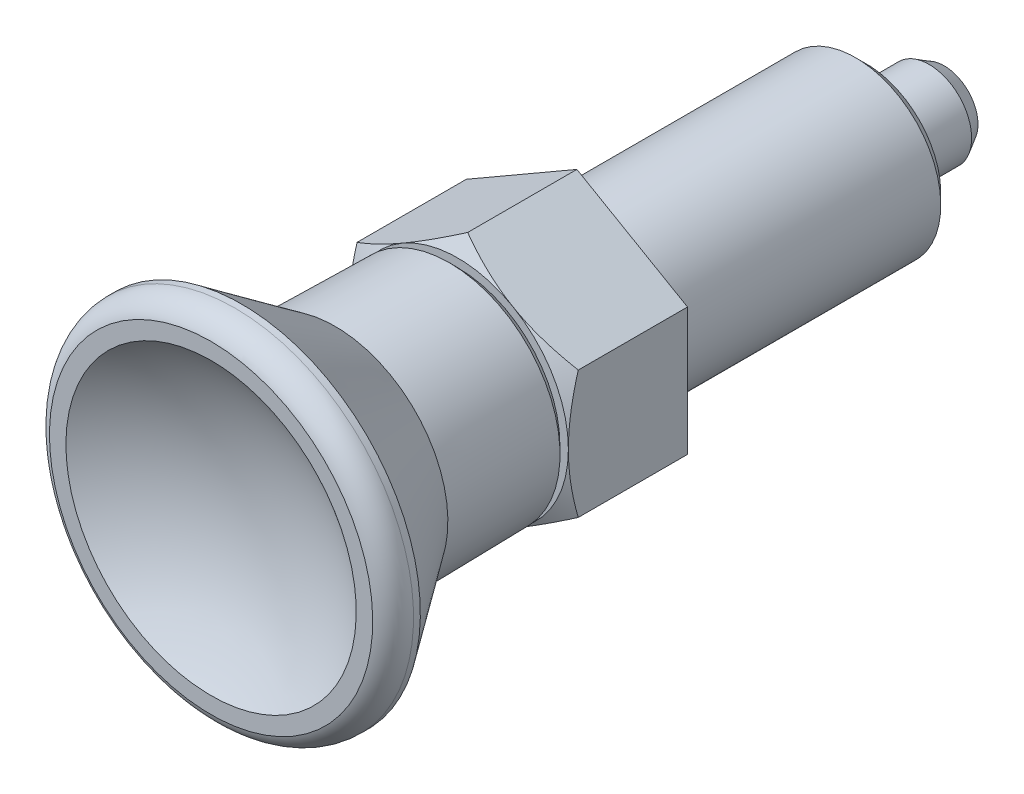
ISO-10303-21;
HEADER;
FILE_DESCRIPTION(('STEP AP214'),'2;1');
FILE_NAME('part.step','',(''),(''),'','','');
FILE_SCHEMA(('AUTOMOTIVE_DESIGN { 1 0 10303 214 1 1 1 1 }'));
ENDSEC;
DATA;
#1=APPLICATION_CONTEXT('core data for automotive mechanical design processes');
#2=APPLICATION_PROTOCOL_DEFINITION('international standard','automotive_design',2000,#1);
#3=PRODUCT_CONTEXT('',#1,'mechanical');
#4=PRODUCT('Part','Part','',(#3));
#5=PRODUCT_RELATED_PRODUCT_CATEGORY('part','',(#4));
#6=PRODUCT_DEFINITION_FORMATION('','',#4);
#7=PRODUCT_DEFINITION_CONTEXT('part definition',#1,'design');
#8=PRODUCT_DEFINITION('design','',#6,#7);
#9=PRODUCT_DEFINITION_SHAPE('','',#8);
#10=(LENGTH_UNIT() NAMED_UNIT(*) SI_UNIT(.MILLI.,.METRE.));
#11=(NAMED_UNIT(*) PLANE_ANGLE_UNIT() SI_UNIT($,.RADIAN.));
#12=(NAMED_UNIT(*) SI_UNIT($,.STERADIAN.) SOLID_ANGLE_UNIT());
#13=UNCERTAINTY_MEASURE_WITH_UNIT(LENGTH_MEASURE(1.E-05),#10,'distance_accuracy_value','');
#14=(GEOMETRIC_REPRESENTATION_CONTEXT(3) GLOBAL_UNCERTAINTY_ASSIGNED_CONTEXT((#13)) GLOBAL_UNIT_ASSIGNED_CONTEXT((#10,
#11,#12)) REPRESENTATION_CONTEXT('',''));
#15=CARTESIAN_POINT('',(0.,0.,0.));
#16=DIRECTION('',(0.,0.,1.));
#17=DIRECTION('',(1.,0.,0.));
#18=AXIS2_PLACEMENT_3D('',#15,#16,#17);
#19=CARTESIAN_POINT('',(0.,0.,-17.));
#20=DIRECTION('',(-1.,0.,0.));
#21=DIRECTION('',(0.,1.,0.));
#22=AXIS2_PLACEMENT_3D('',#19,#20,#21);
#23=SPHERICAL_SURFACE('',#22,5.);
#24=CARTESIAN_POINT('',(0.,0.,-21.5881225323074));
#25=DIRECTION('',(0.,0.,1.));
#26=DIRECTION('',(0.,-1.,0.));
#27=AXIS2_PLACEMENT_3D('',#24,#25,#26);
#28=CIRCLE('',#27,1.98724221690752);
#29=CARTESIAN_POINT('',(0.,-1.98724221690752,-21.5881225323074));
#30=VERTEX_POINT('',#29);
#31=EDGE_CURVE('E18',#30,#30,#28,.T.);
#32=ORIENTED_EDGE('',*,*,#31,.F.);
#33=EDGE_LOOP('',(#32));
#34=FACE_BOUND('',#33,.T.);
#35=ADVANCED_FACE('F14',(#34),#23,.T.);
#36=CARTESIAN_POINT('',(0.,0.,-20.7000000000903));
#37=DIRECTION('',(0.,0.,1.));
#38=DIRECTION('',(0.,-1.,0.));
#39=AXIS2_PLACEMENT_3D('',#36,#37,#38);
#40=CONICAL_SURFACE('',#39,2.49999999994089,0.523598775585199);
#41=CARTESIAN_POINT('',(0.,0.,-20.7));
#42=DIRECTION('',(0.,0.,1.));
#43=DIRECTION('',(0.,-1.,0.));
#44=AXIS2_PLACEMENT_3D('',#41,#42,#43);
#45=CIRCLE('',#44,2.5);
#46=CARTESIAN_POINT('',(0.,-2.5,-20.7));
#47=VERTEX_POINT('',#46);
#48=EDGE_CURVE('E190',#47,#47,#45,.T.);
#49=ORIENTED_EDGE('',*,*,#48,.F.);
#50=EDGE_LOOP('',(#49));
#51=FACE_BOUND('',#50,.T.);
#52=ORIENTED_EDGE('',*,*,#31,.T.);
#53=EDGE_LOOP('',(#52));
#54=FACE_BOUND('',#53,.T.);
#55=ADVANCED_FACE('F297',(#51,#54),#40,.T.);
#56=CARTESIAN_POINT('',(0.,0.,-22.));
#57=DIRECTION('',(0.,0.,1.));
#58=DIRECTION('',(0.,-1.,0.));
#59=AXIS2_PLACEMENT_3D('',#56,#57,#58);
#60=CYLINDRICAL_SURFACE('',#59,2.5);
#61=CARTESIAN_POINT('',(0.,0.,-17.4999999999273));
#62=DIRECTION('',(0.,0.,-1.));
#63=DIRECTION('',(0.,1.,0.));
#64=AXIS2_PLACEMENT_3D('',#61,#62,#63);
#65=CIRCLE('',#64,2.49999999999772);
#66=CARTESIAN_POINT('',(0.,2.49999999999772,-17.4999999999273));
#67=VERTEX_POINT('',#66);
#68=EDGE_CURVE('E185',#67,#67,#65,.F.);
#69=ORIENTED_EDGE('',*,*,#68,.F.);
#70=EDGE_LOOP('',(#69));
#71=FACE_BOUND('',#70,.T.);
#72=ORIENTED_EDGE('',*,*,#48,.T.);
#73=EDGE_LOOP('',(#72));
#74=FACE_BOUND('',#73,.T.);
#75=ADVANCED_FACE('F292',(#71,#74),#60,.T.);
#76=CARTESIAN_POINT('',(0.,0.,-17.4999999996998));
#77=DIRECTION('',(0.,0.,-1.));
#78=DIRECTION('',(0.,1.,0.));
#79=AXIS2_PLACEMENT_3D('',#76,#77,#78);
#80=CONICAL_SURFACE('',#79,2.49999999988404,0.523598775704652);
#81=CARTESIAN_POINT('',(0.,0.,-17.3267949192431));
#82=DIRECTION('',(0.,0.,1.));
#83=DIRECTION('',(0.,-1.,0.));
#84=AXIS2_PLACEMENT_3D('',#81,#82,#83);
#85=CIRCLE('',#84,2.4);
#86=CARTESIAN_POINT('',(0.,-2.4,-17.3267949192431));
#87=VERTEX_POINT('',#86);
#88=EDGE_CURVE('E176',#87,#87,#85,.T.);
#89=ORIENTED_EDGE('',*,*,#88,.F.);
#90=EDGE_LOOP('',(#89));
#91=FACE_BOUND('',#90,.T.);
#92=ORIENTED_EDGE('',*,*,#68,.T.);
#93=EDGE_LOOP('',(#92));
#94=FACE_BOUND('',#93,.T.);
#95=ADVANCED_FACE('F287',(#91,#94),#80,.T.);
#96=CARTESIAN_POINT('',(0.,0.,-22.));
#97=DIRECTION('',(0.,0.,1.));
#98=DIRECTION('',(0.,-1.,0.));
#99=AXIS2_PLACEMENT_3D('',#96,#97,#98);
#100=CYLINDRICAL_SURFACE('',#99,2.4);
#101=CARTESIAN_POINT('',(0.,0.,-17.1999999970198));
#102=DIRECTION('',(0.,0.,-1.));
#103=DIRECTION('',(0.,1.,0.));
#104=AXIS2_PLACEMENT_3D('',#101,#102,#103);
#105=CIRCLE('',#104,2.4);
#106=CARTESIAN_POINT('',(0.,2.4,-17.1999999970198));
#107=VERTEX_POINT('',#106);
#108=EDGE_CURVE('E184',#107,#107,#105,.T.);
#109=ORIENTED_EDGE('',*,*,#108,.T.);
#110=EDGE_LOOP('',(#109));
#111=FACE_BOUND('',#110,.T.);
#112=ORIENTED_EDGE('',*,*,#88,.T.);
#113=EDGE_LOOP('',(#112));
#114=FACE_BOUND('',#113,.T.);
#115=ADVANCED_FACE('F167',(#111,#114),#100,.T.);
#116=CARTESIAN_POINT('',(0.,0.,-17.2));
#117=DIRECTION('',(0.,0.,-1.));
#118=DIRECTION('',(0.,1.,0.));
#119=AXIS2_PLACEMENT_3D('',#116,#117,#118);
#120=TOROIDAL_SURFACE('',#119,2.6,0.200000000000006);
#121=CARTESIAN_POINT('',(0.,0.,-17.));
#122=DIRECTION('',(0.,0.,-1.));
#123=DIRECTION('',(0.,1.,0.));
#124=AXIS2_PLACEMENT_3D('',#121,#122,#123);
#125=CIRCLE('',#124,2.59999999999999);
#126=CARTESIAN_POINT('',(0.,2.59999999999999,-17.));
#127=VERTEX_POINT('',#126);
#128=EDGE_CURVE('E143',#127,#127,#125,.T.);
#129=ORIENTED_EDGE('',*,*,#128,.T.);
#130=EDGE_LOOP('',(#129));
#131=FACE_BOUND('',#130,.T.);
#132=ORIENTED_EDGE('',*,*,#108,.F.);
#133=EDGE_LOOP('',(#132));
#134=FACE_BOUND('',#133,.T.);
#135=ADVANCED_FACE('F161',(#131,#134),#120,.F.);
#136=CARTESIAN_POINT('',(2.82679491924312,0.,-17.));
#137=DIRECTION('',(0.,0.,1.));
#138=DIRECTION('',(0.,-1.,0.));
#139=AXIS2_PLACEMENT_3D('',#136,#137,#138);
#140=PLANE('',#139);
#141=CARTESIAN_POINT('',(0.,0.,-17.0000000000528));
#142=DIRECTION('',(0.,0.,1.));
#143=DIRECTION('',(0.,-1.,0.));
#144=AXIS2_PLACEMENT_3D('',#141,#142,#143);
#145=CIRCLE('',#144,2.82679491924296);
#146=CARTESIAN_POINT('',(0.,-2.82679491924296,-17.0000000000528));
#147=VERTEX_POINT('',#146);
#148=EDGE_CURVE('E136',#147,#147,#145,.T.);
#149=ORIENTED_EDGE('',*,*,#148,.F.);
#150=EDGE_LOOP('',(#149));
#151=FACE_BOUND('',#150,.T.);
#152=ORIENTED_EDGE('',*,*,#128,.F.);
#153=EDGE_LOOP('',(#152));
#154=FACE_BOUND('',#153,.T.);
#155=ADVANCED_FACE('F150',(#151,#154),#140,.F.);
#156=CARTESIAN_POINT('',(0.,0.,-16.7000000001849));
#157=DIRECTION('',(0.,0.,1.));
#158=DIRECTION('',(0.,-1.,0.));
#159=AXIS2_PLACEMENT_3D('',#156,#157,#158);
#160=CONICAL_SURFACE('',#159,2.99999999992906,0.52359877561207);
#161=CARTESIAN_POINT('',(0.,0.,-16.7));
#162=DIRECTION('',(0.,0.,1.));
#163=DIRECTION('',(0.,-1.,0.));
#164=AXIS2_PLACEMENT_3D('',#161,#162,#163);
#165=CIRCLE('',#164,3.);
#166=CARTESIAN_POINT('',(0.,-3.,-16.7));
#167=VERTEX_POINT('',#166);
#168=EDGE_CURVE('E132',#167,#167,#165,.F.);
#169=ORIENTED_EDGE('',*,*,#168,.T.);
#170=EDGE_LOOP('',(#169));
#171=FACE_BOUND('',#170,.T.);
#172=ORIENTED_EDGE('',*,*,#148,.T.);
#173=EDGE_LOOP('',(#172));
#174=FACE_BOUND('',#173,.T.);
#175=ADVANCED_FACE('F160',(#171,#174),#160,.T.);
#176=CARTESIAN_POINT('',(0.,0.,-17.));
#177=DIRECTION('',(0.,0.,1.));
#178=DIRECTION('',(0.,-1.,0.));
#179=AXIS2_PLACEMENT_3D('',#176,#177,#178);
#180=CYLINDRICAL_SURFACE('',#179,3.);
#181=ORIENTED_EDGE('',*,*,#168,.F.);
#182=EDGE_LOOP('',(#181));
#183=FACE_BOUND('',#182,.T.);
#184=CARTESIAN_POINT('',(0.,0.,-17.));
#185=DIRECTION('',(0.,0.,1.));
#186=DIRECTION('',(0.,-1.,0.));
#187=AXIS2_PLACEMENT_3D('',#184,#185,#186);
#188=CIRCLE('',#187,3.);
#189=CARTESIAN_POINT('',(0.,-3.,-17.));
#190=VERTEX_POINT('',#189);
#191=EDGE_CURVE('E135',#190,#190,#188,.T.);
#192=ORIENTED_EDGE('',*,*,#191,.F.);
#193=EDGE_LOOP('',(#192));
#194=FACE_BOUND('',#193,.T.);
#195=ADVANCED_FACE('F255',(#183,#194),#180,.F.);
#196=CARTESIAN_POINT('',(3.,0.,-17.));
#197=DIRECTION('',(0.,0.,-1.));
#198=DIRECTION('',(0.,1.,0.));
#199=AXIS2_PLACEMENT_3D('',#196,#197,#198);
#200=PLANE('',#199);
#201=ORIENTED_EDGE('',*,*,#191,.T.);
#202=EDGE_LOOP('',(#201));
#203=FACE_BOUND('',#202,.T.);
#204=CARTESIAN_POINT('',(0.,0.,-16.9999999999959));
#205=DIRECTION('',(0.,0.,1.));
#206=DIRECTION('',(0.,-1.,0.));
#207=AXIS2_PLACEMENT_3D('',#204,#205,#206);
#208=CIRCLE('',#207,4.38650000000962);
#209=CARTESIAN_POINT('',(0.,-4.38650000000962,-16.9999999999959));
#210=VERTEX_POINT('',#209);
#211=EDGE_CURVE('E129',#210,#210,#208,.T.);
#212=ORIENTED_EDGE('',*,*,#211,.F.);
#213=EDGE_LOOP('',(#212));
#214=FACE_BOUND('',#213,.T.);
#215=ADVANCED_FACE('F246',(#203,#214),#200,.T.);
#216=CARTESIAN_POINT('',(0.,0.,-16.38650000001));
#217=DIRECTION('',(0.,0.,1.));
#218=DIRECTION('',(0.,-1.,0.));
#219=AXIS2_PLACEMENT_3D('',#216,#217,#218);
#220=CONICAL_SURFACE('',#219,5.0000000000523,0.785398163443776);
#221=ORIENTED_EDGE('',*,*,#211,.T.);
#222=EDGE_LOOP('',(#221));
#223=FACE_BOUND('',#222,.T.);
#224=CARTESIAN_POINT('',(0.,0.,-16.3865));
#225=DIRECTION('',(0.,0.,1.));
#226=DIRECTION('',(0.,-1.,0.));
#227=AXIS2_PLACEMENT_3D('',#224,#225,#226);
#228=CIRCLE('',#227,5.);
#229=CARTESIAN_POINT('',(0.,-5.,-16.3865));
#230=VERTEX_POINT('',#229);
#231=EDGE_CURVE('E126',#230,#230,#228,.T.);
#232=ORIENTED_EDGE('',*,*,#231,.F.);
#233=EDGE_LOOP('',(#232));
#234=FACE_BOUND('',#233,.T.);
#235=ADVANCED_FACE('F244',(#223,#234),#220,.T.);
#236=CARTESIAN_POINT('',(0.,0.,32.6));
#237=DIRECTION('',(-1.,0.,0.));
#238=DIRECTION('',(0.,1.,0.));
#239=AXIS2_PLACEMENT_3D('',#236,#237,#238);
#240=SPHERICAL_SURFACE('',#239,14.);
#241=CARTESIAN_POINT('',(0.,8.53170557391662,21.5));
#242=CARTESIAN_POINT('',(-0.239701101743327,8.5317072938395,21.5));
#243=CARTESIAN_POINT('',(-0.479373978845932,8.52159969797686,21.5));
#244=CARTESIAN_POINT('',(-0.95709617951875,8.48123987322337,21.5));
#245=CARTESIAN_POINT('',(-1.19514505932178,8.45098234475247,21.5));
#246=CARTESIAN_POINT('',(-1.66809840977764,8.37048717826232,21.5));
#247=CARTESIAN_POINT('',(-1.90299924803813,8.3202282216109,21.5));
#248=CARTESIAN_POINT('',(-2.36773233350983,8.20008811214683,21.5));
#249=CARTESIAN_POINT('',(-2.59756451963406,8.13020672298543,21.5));
#250=CARTESIAN_POINT('',(-3.05040854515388,7.97135842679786,21.5));
#251=CARTESIAN_POINT('',(-3.27342368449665,7.88240092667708,21.5));
#252=CARTESIAN_POINT('',(-3.71116976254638,7.68601114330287,21.5));
#253=CARTESIAN_POINT('',(-3.92590057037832,7.57857856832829,21.5));
#254=CARTESIAN_POINT('',(-4.34545679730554,7.34605366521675,21.5));
#255=CARTESIAN_POINT('',(-4.55028643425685,7.22096894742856,21.5));
#256=CARTESIAN_POINT('',(-4.94875279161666,6.95394741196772,21.5));
#257=CARTESIAN_POINT('',(-5.14238561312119,6.81200477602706,21.5));
#258=CARTESIAN_POINT('',(-5.51699044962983,6.51232267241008,21.5));
#259=CARTESIAN_POINT('',(-5.69796342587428,6.354584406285,21.5));
#260=CARTESIAN_POINT('',(-6.04598097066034,6.02442080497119,21.5));
#261=CARTESIAN_POINT('',(-6.21302532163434,5.85199524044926,21.5));
#262=CARTESIAN_POINT('',(-6.53199815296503,5.49368132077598,21.5));
#263=CARTESIAN_POINT('',(-6.68392632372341,5.30779269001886,21.5));
#264=CARTESIAN_POINT('',(-6.97158596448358,4.92387306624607,21.5));
#265=CARTESIAN_POINT('',(-7.10731707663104,4.72584180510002,21.5));
#266=CARTESIAN_POINT('',(-7.36158785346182,4.31908993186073,21.5));
#267=CARTESIAN_POINT('',(-7.48013099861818,4.11037149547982,21.5));
#268=CARTESIAN_POINT('',(-7.69925411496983,3.68361770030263,21.5));
#269=CARTESIAN_POINT('',(-7.79982785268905,3.46557914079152,21.5));
#270=CARTESIAN_POINT('',(-7.98222972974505,3.02184395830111,21.5));
#271=CARTESIAN_POINT('',(-8.06406129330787,2.79614874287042,21.5));
#272=CARTESIAN_POINT('',(-8.20842175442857,2.33866337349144,21.5));
#273=CARTESIAN_POINT('',(-8.27095035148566,2.10687312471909,21.5));
#274=CARTESIAN_POINT('',(-8.37625770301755,1.63885297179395,21.5));
#275=CARTESIAN_POINT('',(-8.41903679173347,1.40262314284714,21.5));
#276=CARTESIAN_POINT('',(-8.48454328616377,0.927394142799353,21.5));
#277=CARTESIAN_POINT('',(-8.50727024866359,0.688394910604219,21.5));
#278=CARTESIAN_POINT('',(-8.53250695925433,0.209376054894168,21.5));
#279=CARTESIAN_POINT('',(-8.53502046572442,-0.0306433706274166,21.5));
#280=CARTESIAN_POINT('',(-8.51981962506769,-0.510124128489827,21.5));
#281=CARTESIAN_POINT('',(-8.50209827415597,-0.749585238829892,21.5));
#282=CARTESIAN_POINT('',(-8.44654739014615,-1.22611973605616,21.5));
#283=CARTESIAN_POINT('',(-8.40872148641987,-1.46319354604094,21.5));
#284=CARTESIAN_POINT('',(-8.31323191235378,-1.93331562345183,21.5));
#285=CARTESIAN_POINT('',(-8.2555679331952,-2.16636382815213,21.5));
#286=CARTESIAN_POINT('',(-8.12081350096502,-2.62676991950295,21.5));
#287=CARTESIAN_POINT('',(-8.04372339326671,-2.85412790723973,21.5));
#288=CARTESIAN_POINT('',(-7.87066231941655,-3.30154649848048,21.5));
#289=CARTESIAN_POINT('',(-7.77469093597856,-3.52160694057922,21.5));
#290=CARTESIAN_POINT('',(-7.56457013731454,-3.95282077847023,21.5));
#291=CARTESIAN_POINT('',(-7.45042407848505,-4.16397580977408,21.5));
#292=CARTESIAN_POINT('',(-7.204709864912,-4.57599267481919,21.5));
#293=CARTESIAN_POINT('',(-7.07313569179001,-4.77685091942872,21.5));
#294=CARTESIAN_POINT('',(-6.79355690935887,-5.16673175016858,21.5));
#295=CARTESIAN_POINT('',(-6.64555528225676,-5.35575647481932,21.5));
#296=CARTESIAN_POINT('',(-6.33415193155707,-5.72066897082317,21.5));
#297=CARTESIAN_POINT('',(-6.17074996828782,-5.89655653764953,21.5));
#298=CARTESIAN_POINT('',(-5.82971281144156,-6.23393780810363,21.5));
#299=CARTESIAN_POINT('',(-5.65207788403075,-6.39543178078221,21.5));
#300=CARTESIAN_POINT('',(-5.28383088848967,-6.70288487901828,21.5));
#301=CARTESIAN_POINT('',(-5.09321853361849,-6.8488436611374,21.5));
#302=CARTESIAN_POINT('',(-4.7004116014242,-7.12415919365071,21.5));
#303=CARTESIAN_POINT('',(-4.4982191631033,-7.25351899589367,21.5));
#304=CARTESIAN_POINT('',(-4.08358517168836,-7.49479054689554,21.5));
#305=CARTESIAN_POINT('',(-3.8711400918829,-7.60669623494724,21.5));
#306=CARTESIAN_POINT('',(-3.43761429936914,-7.81219183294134,21.5));
#307=CARTESIAN_POINT('',(-3.21653509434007,-7.90578492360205,21.5));
#308=CARTESIAN_POINT('',(-2.76727776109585,-8.0740143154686,21.5));
#309=CARTESIAN_POINT('',(-2.53909962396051,-8.1486505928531,21.5));
#310=CARTESIAN_POINT('',(-2.0772702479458,-8.2784346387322,21.5));
#311=CARTESIAN_POINT('',(-1.84361908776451,-8.33358268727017,21.5));
#312=CARTESIAN_POINT('',(-1.37249510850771,-8.42400095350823,21.5));
#313=CARTESIAN_POINT('',(-1.13502218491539,-8.45927062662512,21.5));
#314=CARTESIAN_POINT('',(-0.657949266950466,-8.50967905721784,21.5));
#315=CARTESIAN_POINT('',(-0.418349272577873,-8.52481781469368,21.5));
#316=CARTESIAN_POINT('',(0.0612677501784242,-8.53485664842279,21.5));
#317=CARTESIAN_POINT('',(0.301284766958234,-8.52975727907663,21.5));
#318=CARTESIAN_POINT('',(0.780039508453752,-8.49935713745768,21.5));
#319=CARTESIAN_POINT('',(1.01877721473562,-8.47405607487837,21.5));
#320=CARTESIAN_POINT('',(1.49327224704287,-8.40343211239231,21.5));
#321=CARTESIAN_POINT('',(1.72902957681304,-8.3581092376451,21.5));
#322=CARTESIAN_POINT('',(2.1959287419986,-8.24775425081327,21.5));
#323=CARTESIAN_POINT('',(2.42706976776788,-8.18271871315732,21.5));
#324=CARTESIAN_POINT('',(2.88297114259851,-8.0334295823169,21.5));
#325=CARTESIAN_POINT('',(3.10773367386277,-7.94918265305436,21.5));
#326=CARTESIAN_POINT('',(3.54940485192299,-7.76203966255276,21.5));
#327=CARTESIAN_POINT('',(3.7663120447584,-7.65914016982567,21.5));
#328=CARTESIAN_POINT('',(4.19068207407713,-7.43543649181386,21.5));
#329=CARTESIAN_POINT('',(4.39814511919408,-7.31463270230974,21.5));
#330=CARTESIAN_POINT('',(4.80216087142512,-7.05597513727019,21.5));
#331=CARTESIAN_POINT('',(4.99871337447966,-6.91812104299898,21.5));
#332=CARTESIAN_POINT('',(5.37950346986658,-6.62634702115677,21.5));
#333=CARTESIAN_POINT('',(5.56374125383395,-6.47242734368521,21.5));
#334=CARTESIAN_POINT('',(5.91862768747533,-6.14958531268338,21.5));
#335=CARTESIAN_POINT('',(6.08927386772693,-5.98066024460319,21.5));
#336=CARTESIAN_POINT('',(6.41566976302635,-5.62909362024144,21.5));
#337=CARTESIAN_POINT('',(6.57142461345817,-5.44645683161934,21.5));
#338=CARTESIAN_POINT('',(6.86702506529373,-5.068678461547,21.5));
#339=CARTESIAN_POINT('',(7.00686772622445,-4.87353457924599,21.5));
#340=CARTESIAN_POINT('',(7.26961345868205,-4.47216416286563,21.5));
#341=CARTESIAN_POINT('',(7.39251690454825,-4.26593787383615,21.5));
#342=CARTESIAN_POINT('',(7.62051616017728,-3.84386102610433,21.5));
#343=CARTESIAN_POINT('',(7.72561165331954,-3.6280102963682,21.5));
#344=CARTESIAN_POINT('',(7.91724365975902,-3.18822603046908,21.5));
#345=CARTESIAN_POINT('',(8.00378046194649,-2.96429262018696,21.5));
#346=CARTESIAN_POINT('',(8.15769585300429,-2.50989072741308,21.5));
#347=CARTESIAN_POINT('',(8.22507098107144,-2.27942107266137,21.5));
#348=CARTESIAN_POINT('',(8.34014309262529,-1.81370520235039,21.5));
#349=CARTESIAN_POINT('',(8.38784687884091,-1.57846066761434,21.5));
#350=CARTESIAN_POINT('',(8.46327786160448,-1.10474543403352,21.5));
#351=CARTESIAN_POINT('',(8.49100134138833,-0.866274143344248,21.5));
#352=CARTESIAN_POINT('',(8.52625974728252,-0.387849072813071,21.5));
#353=CARTESIAN_POINT('',(8.53379511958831,-0.147895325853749,21.5));
#354=CARTESIAN_POINT('',(8.5286249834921,0.331798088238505,21.5));
#355=CARTESIAN_POINT('',(8.51591913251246,0.571537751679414,21.5));
#356=CARTESIAN_POINT('',(8.47035660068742,1.04909074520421,21.5));
#357=CARTESIAN_POINT('',(8.43750023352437,1.2869041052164,21.5));
#358=CARTESIAN_POINT('',(8.35186267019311,1.75896084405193,21.5));
#359=CARTESIAN_POINT('',(8.29907783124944,1.99320356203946,21.5));
#360=CARTESIAN_POINT('',(8.17398097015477,2.45632829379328,21.5));
#361=CARTESIAN_POINT('',(8.10167571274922,2.68521213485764,21.5));
#362=CARTESIAN_POINT('',(7.93802712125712,3.13612216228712,21.5));
#363=CARTESIAN_POINT('',(7.84667992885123,3.35814694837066,21.5));
#364=CARTESIAN_POINT('',(7.64560805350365,3.79370687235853,21.5));
#365=CARTESIAN_POINT('',(7.53588377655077,4.00724219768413,21.5));
#366=CARTESIAN_POINT('',(7.29883882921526,4.42430601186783,21.5));
#367=CARTESIAN_POINT('',(7.1715185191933,4.62783470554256,21.5));
#368=CARTESIAN_POINT('',(6.90018708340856,5.02343989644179,21.5));
#369=CARTESIAN_POINT('',(6.75617621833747,5.2155165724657,21.5));
#370=CARTESIAN_POINT('',(6.45247425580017,5.58686986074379,21.5));
#371=CARTESIAN_POINT('',(6.29278196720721,5.76614549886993,21.5));
#372=CARTESIAN_POINT('',(5.95891965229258,6.11054627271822,21.5));
#373=CARTESIAN_POINT('',(5.78475465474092,6.27567628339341,21.5));
#374=CARTESIAN_POINT('',(5.42305871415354,6.59074977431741,21.5));
#375=CARTESIAN_POINT('',(5.23552205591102,6.74068669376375,21.5));
#376=CARTESIAN_POINT('',(4.84848604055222,7.02422451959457,21.5));
#377=CARTESIAN_POINT('',(4.64898687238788,7.15782568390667,21.5));
#378=CARTESIAN_POINT('',(4.23934049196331,7.4078063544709,21.5));
#379=CARTESIAN_POINT('',(4.02918808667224,7.52417735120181,21.5));
#380=CARTESIAN_POINT('',(3.59982553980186,7.73878930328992,21.5));
#381=CARTESIAN_POINT('',(3.38061550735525,7.83703047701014,21.5));
#382=CARTESIAN_POINT('',(2.93492880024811,8.01459089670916,21.5));
#383=CARTESIAN_POINT('',(2.70846013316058,8.09393023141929,21.5));
#384=CARTESIAN_POINT('',(2.24972197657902,8.23323823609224,21.5));
#385=CARTESIAN_POINT('',(2.01745402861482,8.29321199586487,21.5));
#386=CARTESIAN_POINT('',(1.49030380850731,8.40586518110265,21.5));
#387=CARTESIAN_POINT('',(1.19422371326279,8.45301528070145,21.5));
#388=CARTESIAN_POINT('',(0.598747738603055,8.51593440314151,21.5));
#389=CARTESIAN_POINT('',(0.299351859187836,8.53170342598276,21.5));
#390=CARTESIAN_POINT('',(0.,8.53170557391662,21.5));
#391=B_SPLINE_CURVE_WITH_KNOTS('',3,(#241,#242,#243,#244,#245,#246,#247,#248,#249,#250,#251,
#252,#253,#254,#255,#256,#257,#258,#259,#260,#261,#262,#263,#264,#265,#266,#267,#268,#269,#270,
#271,#272,#273,#274,#275,#276,#277,#278,#279,#280,#281,#282,#283,#284,#285,#286,#287,#288,#289,
#290,#291,#292,#293,#294,#295,#296,#297,#298,#299,#300,#301,#302,#303,#304,#305,#306,#307,#308,
#309,#310,#311,#312,#313,#314,#315,#316,#317,#318,#319,#320,#321,#322,#323,#324,#325,#326,#327,
#328,#329,#330,#331,#332,#333,#334,#335,#336,#337,#338,#339,#340,#341,#342,#343,#344,#345,#346,
#347,#348,#349,#350,#351,#352,#353,#354,#355,#356,#357,#358,#359,#360,#361,#362,#363,#364,#365,
#366,#367,#368,#369,#370,#371,#372,#373,#374,#375,#376,#377,#378,#379,#380,#381,#382,#383,#384,
#385,#386,#387,#388,#389,#390),.UNSPECIFIED.,.T.,.F.,(4,2,2,2,2,2,2,2,2,2,2,2,2,2,2,2,2,2,2,2,2,
2,2,2,2,2,2,2,2,2,2,2,2,2,2,2,2,2,2,2,2,2,2,2,2,2,2,2,2,2,2,2,2,2,2,2,2,2,2,2,2,2,2,2,2,2,2,2,2,
2,2,2,2,2,4),(0.,0.718841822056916,1.43787277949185,2.15767218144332,2.87748025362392,
3.59693418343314,4.316399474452,5.03555552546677,5.75496050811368,6.47431080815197,
7.19367234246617,7.91304860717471,8.63244076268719,9.3516870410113,10.0711823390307,
10.790546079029,11.5099210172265,12.2292837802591,12.9486624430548,13.6679073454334,
14.387401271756,15.1067653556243,15.8261406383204,16.5455031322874,17.2648815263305,
17.9841272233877,18.7036219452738,19.422986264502,20.1423617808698,20.8617238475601,
21.5811018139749,22.3003473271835,23.0198420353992,23.7392116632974,24.4585821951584,
25.1779423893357,25.8973222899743,26.616702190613,27.3360623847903,28.0554329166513,
28.7748025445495,29.4942972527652,30.2135427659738,30.9329207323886,31.6522827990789,
32.3716583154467,33.0910226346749,33.8105173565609,34.5297630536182,35.2491414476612,
35.9685039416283,36.6878792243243,37.4072433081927,38.1267372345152,38.8459821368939,
39.5653607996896,40.2847235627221,41.0040985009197,41.7234622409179,42.4429575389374,
43.1622038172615,43.881595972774,44.6009722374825,45.3203337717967,46.039684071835,
46.7590890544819,47.4782451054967,48.1977103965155,48.9171643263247,49.6369723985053,
50.3567718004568,51.0758027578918,51.7946445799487,52.6923736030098,53.5901026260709),.UNSPECIFIED.);
#392=CARTESIAN_POINT('',(0.,8.53170557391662,21.5));
#393=VERTEX_POINT('',#392);
#394=EDGE_CURVE('E205',#393,#393,#391,.T.);
#395=ORIENTED_EDGE('',*,*,#394,.T.);
#396=EDGE_LOOP('',(#395));
#397=FACE_BOUND('',#396,.T.);
#398=ADVANCED_FACE('F215',(#397),#240,.F.);
#399=CARTESIAN_POINT('',(8.53170557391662,0.,21.5));
#400=DIRECTION('',(0.,0.,-1.));
#401=DIRECTION('',(0.,1.,0.));
#402=AXIS2_PLACEMENT_3D('',#399,#400,#401);
#403=PLANE('',#402);
#404=ORIENTED_EDGE('',*,*,#394,.F.);
#405=EDGE_LOOP('',(#404));
#406=FACE_BOUND('',#405,.T.);
#407=CARTESIAN_POINT('',(0.,0.,21.5));
#408=DIRECTION('',(0.,0.,-1.));
#409=DIRECTION('',(0.,1.,0.));
#410=AXIS2_PLACEMENT_3D('',#407,#408,#409);
#411=CIRCLE('',#410,9.50000000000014);
#412=CARTESIAN_POINT('',(0.,9.50000000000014,21.5));
#413=VERTEX_POINT('',#412);
#414=EDGE_CURVE('E198',#413,#413,#411,.T.);
#415=ORIENTED_EDGE('',*,*,#414,.F.);
#416=EDGE_LOOP('',(#415));
#417=FACE_BOUND('',#416,.T.);
#418=ADVANCED_FACE('F220',(#406,#417),#403,.F.);
#419=CARTESIAN_POINT('',(0.,0.,20.0857625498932));
#420=DIRECTION('',(0.,0.,-1.));
#421=DIRECTION('',(0.,1.,0.));
#422=AXIS2_PLACEMENT_3D('',#419,#420,#421);
#423=TOROIDAL_SURFACE('',#422,9.00006756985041,1.5);
#424=CARTESIAN_POINT('',(0.,0.,20.1));
#425=DIRECTION('',(0.,0.,1.));
#426=DIRECTION('',(0.,-1.,0.));
#427=AXIS2_PLACEMENT_3D('',#424,#425,#426);
#428=CIRCLE('',#427,10.5);
#429=CARTESIAN_POINT('',(0.,-10.5,20.1));
#430=VERTEX_POINT('',#429);
#431=EDGE_CURVE('E662',#430,#430,#428,.F.);
#432=ORIENTED_EDGE('',*,*,#431,.F.);
#433=EDGE_LOOP('',(#432));
#434=FACE_BOUND('',#433,.T.);
#435=ORIENTED_EDGE('',*,*,#414,.T.);
#436=EDGE_LOOP('',(#435));
#437=FACE_BOUND('',#436,.T.);
#438=ADVANCED_FACE('F224',(#434,#437),#423,.T.);
#439=CARTESIAN_POINT('',(0.,0.,-22.));
#440=DIRECTION('',(0.,0.,1.));
#441=DIRECTION('',(0.,-1.,0.));
#442=AXIS2_PLACEMENT_3D('',#439,#440,#441);
#443=CYLINDRICAL_SURFACE('',#442,10.5);
#444=ORIENTED_EDGE('',*,*,#431,.T.);
#445=EDGE_LOOP('',(#444));
#446=FACE_BOUND('',#445,.T.);
#447=CARTESIAN_POINT('',(0.,0.,19.7));
#448=DIRECTION('',(0.,0.,1.));
#449=DIRECTION('',(0.,-1.,0.));
#450=AXIS2_PLACEMENT_3D('',#447,#448,#449);
#451=CIRCLE('',#450,10.5);
#452=CARTESIAN_POINT('',(0.,-10.5,19.7));
#453=VERTEX_POINT('',#452);
#454=EDGE_CURVE('E9',#453,#453,#451,.F.);
#455=ORIENTED_EDGE('',*,*,#454,.F.);
#456=EDGE_LOOP('',(#455));
#457=FACE_BOUND('',#456,.T.);
#458=ADVANCED_FACE('F403',(#446,#457),#443,.T.);
#459=CARTESIAN_POINT('',(0.,0.,19.7));
#460=DIRECTION('',(0.,0.,1.));
#461=DIRECTION('',(0.,-1.,0.));
#462=AXIS2_PLACEMENT_3D('',#459,#460,#461);
#463=CONICAL_SURFACE('',#462,10.5,0.614355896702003);
#464=ORIENTED_EDGE('',*,*,#454,.T.);
#465=EDGE_LOOP('',(#464));
#466=FACE_BOUND('',#465,.T.);
#467=CARTESIAN_POINT('',(0.,0.,14.2079940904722));
#468=DIRECTION('',(0.,0.,1.));
#469=DIRECTION('',(0.,-1.,0.));
#470=AXIS2_PLACEMENT_3D('',#467,#468,#469);
#471=CIRCLE('',#470,6.62581600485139);
#472=CARTESIAN_POINT('',(0.,-6.62581600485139,14.2079940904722));
#473=VERTEX_POINT('',#472);
#474=EDGE_CURVE('E24',#473,#473,#471,.T.);
#475=ORIENTED_EDGE('',*,*,#474,.T.);
#476=EDGE_LOOP('',(#475));
#477=FACE_BOUND('',#476,.T.);
#478=ADVANCED_FACE('F410',(#466,#477),#463,.T.);
#479=CARTESIAN_POINT('',(0.,0.,14.2079940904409));
#480=DIRECTION('',(0.,0.,1.));
#481=DIRECTION('',(0.,-1.,0.));
#482=AXIS2_PLACEMENT_3D('',#479,#480,#481);
#483=CONICAL_SURFACE('',#482,6.62581600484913,0.0174532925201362);
#484=ORIENTED_EDGE('',*,*,#474,.F.);
#485=EDGE_LOOP('',(#484));
#486=FACE_BOUND('',#485,.T.);
#487=CARTESIAN_POINT('',(0.,0.,7.4999238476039));
#488=DIRECTION('',(0.,0.,1.));
#489=DIRECTION('',(0.,-1.,0.));
#490=AXIS2_PLACEMENT_3D('',#487,#488,#489);
#491=CIRCLE('',#490,6.50872620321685);
#492=CARTESIAN_POINT('',(0.,-6.50872620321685,7.4999238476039));
#493=VERTEX_POINT('',#492);
#494=EDGE_CURVE('E201',#493,#493,#491,.T.);
#495=ORIENTED_EDGE('',*,*,#494,.T.);
#496=EDGE_LOOP('',(#495));
#497=FACE_BOUND('',#496,.T.);
#498=ADVANCED_FACE('F240',(#486,#497),#483,.T.);
#499=CARTESIAN_POINT('',(0.,0.,7.4999238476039));
#500=DIRECTION('',(0.,0.,1.));
#501=DIRECTION('',(0.,-1.,0.));
#502=AXIS2_PLACEMENT_3D('',#499,#500,#501);
#503=CONICAL_SURFACE('',#502,6.50872620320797,0.794124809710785);
#504=ORIENTED_EDGE('',*,*,#494,.F.);
#505=EDGE_LOOP('',(#504));
#506=FACE_BOUND('',#505,.T.);
#507=CARTESIAN_POINT('',(0.,0.,7.00000000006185));
#508=DIRECTION('',(0.,0.,1.));
#509=DIRECTION('',(0.,-1.,0.));
#510=AXIS2_PLACEMENT_3D('',#507,#508,#509);
#511=CIRCLE('',#510,5.99999999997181);
#512=CARTESIAN_POINT('',(0.,-5.99999999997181,7.00000000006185));
#513=VERTEX_POINT('',#512);
#514=EDGE_CURVE('E202',#513,#513,#511,.T.);
#515=ORIENTED_EDGE('',*,*,#514,.T.);
#516=EDGE_LOOP('',(#515));
#517=FACE_BOUND('',#516,.T.);
#518=ADVANCED_FACE('F226',(#506,#517),#503,.T.);
#519=CARTESIAN_POINT('',(6.5,0.,7.));
#520=DIRECTION('',(0.,0.,1.));
#521=DIRECTION('',(0.,-1.,0.));
#522=AXIS2_PLACEMENT_3D('',#519,#520,#521);
#523=PLANE('',#522);
#524=CARTESIAN_POINT('',(0.,0.,7.));
#525=DIRECTION('',(0.,0.,-1.));
#526=DIRECTION('',(1.,0.,0.));
#527=AXIS2_PLACEMENT_3D('',#524,#525,#526);
#528=CIRCLE('',#527,6.5);
#529=CARTESIAN_POINT('',(-6.5,0.,7.));
#530=VERTEX_POINT('',#529);
#531=CARTESIAN_POINT('',(-3.25,-5.62916512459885,7.));
#532=VERTEX_POINT('',#531);
#533=EDGE_CURVE('E690',#530,#532,#528,.F.);
#534=ORIENTED_EDGE('',*,*,#533,.T.);
#535=CARTESIAN_POINT('',(0.,0.,7.));
#536=DIRECTION('',(0.,0.,-1.));
#537=DIRECTION('',(0.,1.,0.));
#538=AXIS2_PLACEMENT_3D('',#535,#536,#537);
#539=CIRCLE('',#538,6.5);
#540=CARTESIAN_POINT('',(3.25,-5.62916512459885,7.));
#541=VERTEX_POINT('',#540);
#542=EDGE_CURVE('E213',#532,#541,#539,.F.);
#543=ORIENTED_EDGE('',*,*,#542,.T.);
#544=CARTESIAN_POINT('',(0.,0.,7.));
#545=DIRECTION('',(0.,0.,-1.));
#546=DIRECTION('',(1.,0.,0.));
#547=AXIS2_PLACEMENT_3D('',#544,#545,#546);
#548=CIRCLE('',#547,6.5);
#549=CARTESIAN_POINT('',(6.5,0.,7.));
#550=VERTEX_POINT('',#549);
#551=EDGE_CURVE('E647',#541,#550,#548,.F.);
#552=ORIENTED_EDGE('',*,*,#551,.T.);
#553=CARTESIAN_POINT('',(0.,0.,7.));
#554=DIRECTION('',(0.,0.,-1.));
#555=DIRECTION('',(1.,0.,0.));
#556=AXIS2_PLACEMENT_3D('',#553,#554,#555);
#557=CIRCLE('',#556,6.5);
#558=CARTESIAN_POINT('',(3.25,5.62916512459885,7.));
#559=VERTEX_POINT('',#558);
#560=EDGE_CURVE('E700',#550,#559,#557,.F.);
#561=ORIENTED_EDGE('',*,*,#560,.T.);
#562=CARTESIAN_POINT('',(0.,0.,7.));
#563=DIRECTION('',(0.,0.,-1.));
#564=DIRECTION('',(0.,1.,0.));
#565=AXIS2_PLACEMENT_3D('',#562,#563,#564);
#566=CIRCLE('',#565,6.5);
#567=CARTESIAN_POINT('',(-3.25,5.62916512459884,7.));
#568=VERTEX_POINT('',#567);
#569=EDGE_CURVE('E698',#559,#568,#566,.F.);
#570=ORIENTED_EDGE('',*,*,#569,.T.);
#571=CARTESIAN_POINT('',(0.,0.,7.));
#572=DIRECTION('',(0.,0.,-1.));
#573=DIRECTION('',(1.,0.,0.));
#574=AXIS2_PLACEMENT_3D('',#571,#572,#573);
#575=CIRCLE('',#574,6.5);
#576=EDGE_CURVE('E694',#568,#530,#575,.F.);
#577=ORIENTED_EDGE('',*,*,#576,.T.);
#578=EDGE_LOOP('',(#534,#543,#552,#561,#570,#577));
#579=FACE_BOUND('',#578,.T.);
#580=ORIENTED_EDGE('',*,*,#514,.F.);
#581=EDGE_LOOP('',(#580));
#582=FACE_BOUND('',#581,.T.);
#583=ADVANCED_FACE('F228',(#579,#582),#523,.T.);
#584=CARTESIAN_POINT('',(0.,0.,6.41596007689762));
#585=DIRECTION('',(0.,0.,-1.));
#586=DIRECTION('',(0.,1.,0.));
#587=AXIS2_PLACEMENT_3D('',#584,#585,#586);
#588=CONICAL_SURFACE('',#587,7.51158682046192,1.0471975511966);
#589=ORIENTED_EDGE('',*,*,#542,.F.);
#590=CARTESIAN_POINT('',(-3.25,-5.62916512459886,7.));
#591=CARTESIAN_POINT('',(-3.11205573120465,-5.70880728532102,7.00002656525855));
#592=CARTESIAN_POINT('',(-2.97411810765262,-5.78844560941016,6.99662027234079));
#593=CARTESIAN_POINT('',(-2.69851370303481,-5.9475658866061,6.98313941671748));
#594=CARTESIAN_POINT('',(-2.56084687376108,-6.02704786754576,6.97306617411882));
#595=CARTESIAN_POINT('',(-2.28667327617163,-6.18534206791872,6.94651519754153));
#596=CARTESIAN_POINT('',(-2.15016414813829,-6.26415564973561,6.93006970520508));
#597=CARTESIAN_POINT('',(-1.87779626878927,-6.42140731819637,6.89112797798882));
#598=CARTESIAN_POINT('',(-1.74193753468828,-6.49984539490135,6.86863158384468));
#599=CARTESIAN_POINT('',(-1.33590006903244,-6.73427123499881,6.79276102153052));
#600=CARTESIAN_POINT('',(-1.06690089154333,-6.88957798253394,6.73096863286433));
#601=CARTESIAN_POINT('',(-0.531215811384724,-7.19885590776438,6.58845957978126));
#602=CARTESIAN_POINT('',(-0.264548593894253,-7.35281629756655,6.50764840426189));
#603=CARTESIAN_POINT('',(2.31893864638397E-08,-7.50555351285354,6.41944340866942));
#604=B_SPLINE_CURVE_WITH_KNOTS('',3,(#590,#591,#592,#593,#594,#595,#596,#597,#598,#599,#600,
#601,#602,#603),.UNSPECIFIED.,.F.,.F.,(4,2,2,2,2,2,4),(0.,0.477804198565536,0.955513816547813,
1.43083728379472,1.90617326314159,2.85559937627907,3.80984703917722),.UNSPECIFIED.);
#605=CARTESIAN_POINT('',(3.7514421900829E-08,-7.50555347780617,6.41944342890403));
#606=VERTEX_POINT('',#605);
#607=EDGE_CURVE('E33',#532,#606,#604,.T.);
#608=ORIENTED_EDGE('',*,*,#607,.T.);
#609=CARTESIAN_POINT('',(7.50288455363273E-08,-7.50555345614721,6.41944344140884));
#610=CARTESIAN_POINT('',(0.264548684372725,-7.35281624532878,6.50764843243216));
#611=CARTESIAN_POINT('',(0.531215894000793,-7.19885586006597,6.58845960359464));
#612=CARTESIAN_POINT('',(1.06690095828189,-6.88957794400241,6.73096864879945));
#613=CARTESIAN_POINT('',(1.33590012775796,-6.73427120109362,6.79276103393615));
#614=CARTESIAN_POINT('',(1.741937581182,-6.49984536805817,6.86863159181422));
#615=CARTESIAN_POINT('',(1.87779631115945,-6.42140729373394,6.89112798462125));
#616=CARTESIAN_POINT('',(2.15016418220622,-6.26415563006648,6.93006970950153));
#617=CARTESIAN_POINT('',(2.28667330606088,-6.18534205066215,6.94651520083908));
#618=CARTESIAN_POINT('',(2.5608468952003,-6.02704785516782,6.97306617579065));
#619=CARTESIAN_POINT('',(2.69851372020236,-5.9475658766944,6.98313941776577));
#620=CARTESIAN_POINT('',(2.97411811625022,-5.78844560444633,6.99662027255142));
#621=CARTESIAN_POINT('',(3.11205573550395,-5.70880728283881,7.0000265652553));
#622=CARTESIAN_POINT('',(3.25,-5.62916512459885,7.));
#623=B_SPLINE_CURVE_WITH_KNOTS('',3,(#609,#610,#611,#612,#613,#614,#615,#616,#617,#618,#619,
#620,#621,#622),.UNSPECIFIED.,.F.,.F.,(4,2,2,2,2,2,4),(0.,0.954247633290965,1.90367371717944,
2.37900968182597,2.85433313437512,3.33204273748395,3.80984692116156),.UNSPECIFIED.);
#624=EDGE_CURVE('E585',#606,#541,#623,.T.);
#625=ORIENTED_EDGE('',*,*,#624,.T.);
#626=EDGE_LOOP('',(#589,#608,#625));
#627=FACE_BOUND('',#626,.T.);
#628=ADVANCED_FACE('F230',(#627),#588,.T.);
#629=CARTESIAN_POINT('',(0.,0.,6.41596007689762));
#630=DIRECTION('',(0.,0.,-1.));
#631=DIRECTION('',(1.,0.,0.));
#632=AXIS2_PLACEMENT_3D('',#629,#630,#631);
#633=CONICAL_SURFACE('',#632,7.51158682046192,1.0471975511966);
#634=ORIENTED_EDGE('',*,*,#551,.F.);
#635=CARTESIAN_POINT('',(3.25,-5.62916512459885,7.));
#636=CARTESIAN_POINT('',(3.38794426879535,-5.54952296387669,7.00002656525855));
#637=CARTESIAN_POINT('',(3.52588189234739,-5.46988463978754,6.99662027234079));
#638=CARTESIAN_POINT('',(3.8014862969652,-5.3107643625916,6.98313941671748));
#639=CARTESIAN_POINT('',(3.93915312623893,-5.23128238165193,6.97306617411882));
#640=CARTESIAN_POINT('',(4.21332672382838,-5.07298818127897,6.94651519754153));
#641=CARTESIAN_POINT('',(4.34983585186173,-4.99417459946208,6.93006970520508));
#642=CARTESIAN_POINT('',(4.62220373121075,-4.83692293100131,6.89112797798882));
#643=CARTESIAN_POINT('',(4.75806246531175,-4.75848485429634,6.86863158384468));
#644=CARTESIAN_POINT('',(5.16409993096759,-4.52405901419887,6.79276102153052));
#645=CARTESIAN_POINT('',(5.4330991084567,-4.36875226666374,6.73096863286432));
#646=CARTESIAN_POINT('',(5.96878418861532,-4.05947434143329,6.58845957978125));
#647=CARTESIAN_POINT('',(6.2354514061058,-3.90551395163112,6.50764840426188));
#648=CARTESIAN_POINT('',(6.50000002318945,-3.75277673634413,6.41944340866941));
#649=B_SPLINE_CURVE_WITH_KNOTS('',3,(#635,#636,#637,#638,#639,#640,#641,#642,#643,#644,#645,
#646,#647,#648),.UNSPECIFIED.,.F.,.F.,(4,2,2,2,2,2,4),(0.,0.477804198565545,0.955513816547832,
1.43083728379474,1.90617326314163,2.85559937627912,3.8098470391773),.UNSPECIFIED.);
#650=CARTESIAN_POINT('',(6.5,-3.75277670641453,6.41944342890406));
#651=VERTEX_POINT('',#650);
#652=EDGE_CURVE('E558',#541,#651,#649,.T.);
#653=ORIENTED_EDGE('',*,*,#652,.T.);
#654=CARTESIAN_POINT('',(6.5,-3.75277666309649,6.4194434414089));
#655=CARTESIAN_POINT('',(6.5,-3.44730224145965,6.50764843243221));
#656=CARTESIAN_POINT('',(6.5,-3.13938147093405,6.58845960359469));
#657=CARTESIAN_POINT('',(6.5,-2.52082563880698,6.73096864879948));
#658=CARTESIAN_POINT('',(6.5,-2.2102121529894,6.79276103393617));
#659=CARTESIAN_POINT('',(6.5,-1.74136048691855,6.86863159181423));
#660=CARTESIAN_POINT('',(6.5,-1.58448433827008,6.89112798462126));
#661=CARTESIAN_POINT('',(6.5,-1.26998101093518,6.93006970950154));
#662=CARTESIAN_POINT('',(6.5,-1.11235385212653,6.94651520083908));
#663=CARTESIAN_POINT('',(6.5,-0.795765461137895,6.97306617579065));
#664=CARTESIAN_POINT('',(6.5,-0.636801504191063,6.98313941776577));
#665=CARTESIAN_POINT('',(6.5,-0.318560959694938,6.99662027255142));
#666=CARTESIAN_POINT('',(6.5,-0.15928431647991,7.0000265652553));
#667=CARTESIAN_POINT('',(6.5,0.,7.));
#668=B_SPLINE_CURVE_WITH_KNOTS('',3,(#654,#655,#656,#657,#658,#659,#660,#661,#662,#663,#664,
#665,#666,#667),.UNSPECIFIED.,.F.,.F.,(4,2,2,2,2,2,4),(0.,0.954247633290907,1.90367371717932,
2.37900968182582,2.85433313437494,3.33204273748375,3.80984692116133),.UNSPECIFIED.);
#669=EDGE_CURVE('E68',#651,#550,#668,.T.);
#670=ORIENTED_EDGE('',*,*,#669,.T.);
#671=EDGE_LOOP('',(#634,#653,#670));
#672=FACE_BOUND('',#671,.T.);
#673=ADVANCED_FACE('F238',(#672),#633,.T.);
#674=CARTESIAN_POINT('',(0.,0.,6.41596007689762));
#675=DIRECTION('',(0.,0.,-1.));
#676=DIRECTION('',(1.,0.,0.));
#677=AXIS2_PLACEMENT_3D('',#674,#675,#676);
#678=CONICAL_SURFACE('',#677,7.51158682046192,1.0471975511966);
#679=ORIENTED_EDGE('',*,*,#560,.F.);
#680=CARTESIAN_POINT('',(6.5,0.,7.));
#681=CARTESIAN_POINT('',(6.5,0.159284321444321,7.00002656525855));
#682=CARTESIAN_POINT('',(6.5,0.31856096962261,6.99662027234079));
#683=CARTESIAN_POINT('',(6.5,0.636801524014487,6.98313941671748));
#684=CARTESIAN_POINT('',(6.5,0.795765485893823,6.97306617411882));
#685=CARTESIAN_POINT('',(6.5,1.11235388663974,6.94651519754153));
#686=CARTESIAN_POINT('',(6.5,1.26998105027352,6.93006970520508));
#687=CARTESIAN_POINT('',(6.5,1.58448438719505,6.89112797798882));
#688=CARTESIAN_POINT('',(6.5,1.74136054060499,6.86863158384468));
#689=CARTESIAN_POINT('',(6.5,2.21021222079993,6.79276102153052));
#690=CARTESIAN_POINT('',(6.5,2.52082571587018,6.73096863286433));
#691=CARTESIAN_POINT('',(6.5,3.13938156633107,6.58845957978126));
#692=CARTESIAN_POINT('',(6.5,3.44730234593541,6.50764840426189));
#693=CARTESIAN_POINT('',(6.5,3.75277677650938,6.41944340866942));
#694=B_SPLINE_CURVE_WITH_KNOTS('',3,(#680,#681,#682,#683,#684,#685,#686,#687,#688,#689,#690,
#691,#692,#693),.UNSPECIFIED.,.F.,.F.,(4,2,2,2,2,2,4),(0.,0.477804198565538,0.955513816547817,
1.43083728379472,1.9061732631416,2.85559937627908,3.80984703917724),.UNSPECIFIED.);
#695=CARTESIAN_POINT('',(6.49999996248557,3.75277677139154,6.41944342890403));
#696=VERTEX_POINT('',#695);
#697=EDGE_CURVE('E633',#550,#696,#694,.T.);
#698=ORIENTED_EDGE('',*,*,#697,.T.);
#699=CARTESIAN_POINT('',(6.49999992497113,3.75277679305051,6.41944344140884));
#700=CARTESIAN_POINT('',(6.23545131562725,3.90551400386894,6.50764843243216));
#701=CARTESIAN_POINT('',(5.96878410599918,4.05947438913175,6.58845960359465));
#702=CARTESIAN_POINT('',(5.43309904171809,4.3687523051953,6.73096864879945));
#703=CARTESIAN_POINT('',(5.16409987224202,4.52405904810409,6.79276103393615));
#704=CARTESIAN_POINT('',(4.75806241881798,4.75848488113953,6.86863159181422));
#705=CARTESIAN_POINT('',(4.62220368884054,4.83692295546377,6.89112798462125));
#706=CARTESIAN_POINT('',(4.34983581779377,4.99417461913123,6.93006970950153));
#707=CARTESIAN_POINT('',(4.21332669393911,5.07298819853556,6.94651520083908));
#708=CARTESIAN_POINT('',(3.93915310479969,5.23128239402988,6.97306617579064));
#709=CARTESIAN_POINT('',(3.80148627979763,5.3107643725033,6.98313941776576));
#710=CARTESIAN_POINT('',(3.52588188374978,5.46988464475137,6.99662027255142));
#711=CARTESIAN_POINT('',(3.38794426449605,5.54952296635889,7.0000265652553));
#712=CARTESIAN_POINT('',(3.25,5.62916512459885,7.));
#713=B_SPLINE_CURVE_WITH_KNOTS('',3,(#699,#700,#701,#702,#703,#704,#705,#706,#707,#708,#709,
#710,#711,#712),.UNSPECIFIED.,.F.,.F.,(4,2,2,2,2,2,4),(0.,0.954247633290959,1.90367371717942,
2.37900968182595,2.85433313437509,3.33204273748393,3.80984692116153),.UNSPECIFIED.);
#714=EDGE_CURVE('E110',#696,#559,#713,.T.);
#715=ORIENTED_EDGE('',*,*,#714,.T.);
#716=EDGE_LOOP('',(#679,#698,#715));
#717=FACE_BOUND('',#716,.T.);
#718=ADVANCED_FACE('F432',(#717),#678,.T.);
#719=CARTESIAN_POINT('',(0.,0.,6.41596007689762));
#720=DIRECTION('',(0.,0.,-1.));
#721=DIRECTION('',(0.,1.,0.));
#722=AXIS2_PLACEMENT_3D('',#719,#720,#721);
#723=CONICAL_SURFACE('',#722,7.51158682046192,1.0471975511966);
#724=ORIENTED_EDGE('',*,*,#569,.F.);
#725=CARTESIAN_POINT('',(3.25,5.62916512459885,7.));
#726=CARTESIAN_POINT('',(3.1120557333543,5.70880728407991,7.00002656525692));
#727=CARTESIAN_POINT('',(2.97411811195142,5.78844560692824,6.9966202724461));
#728=CARTESIAN_POINT('',(2.69851371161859,5.94756588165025,6.98313941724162));
#729=CARTESIAN_POINT('',(2.5608468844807,6.02704786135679,6.97306617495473));
#730=CARTESIAN_POINT('',(2.28667329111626,6.18534205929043,6.94651519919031));
#731=CARTESIAN_POINT('',(2.15016416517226,6.26415563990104,6.9300697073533));
#732=CARTESIAN_POINT('',(1.87779628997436,6.42140730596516,6.89112798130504));
#733=CARTESIAN_POINT('',(1.74193755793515,6.49984538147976,6.86863158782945));
#734=CARTESIAN_POINT('',(1.33590009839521,6.73427121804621,6.79276102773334));
#735=CARTESIAN_POINT('',(1.06690092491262,6.88957796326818,6.73096864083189));
#736=CARTESIAN_POINT('',(0.531215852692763,7.19885588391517,6.58845959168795));
#737=CARTESIAN_POINT('',(0.264548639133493,7.35281627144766,6.50764841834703));
#738=CARTESIAN_POINT('',(2.5919731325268E-08,7.50555348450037,6.41944342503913));
#739=B_SPLINE_CURVE_WITH_KNOTS('',3,(#725,#726,#727,#728,#729,#730,#731,#732,#733,#734,#735,
#736,#737,#738),.UNSPECIFIED.,.F.,.F.,(4,2,2,2,2,2,4),(0.,0.477804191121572,0.955513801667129,
1.43083726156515,1.90617323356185,2.85559933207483,3.80984698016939),.UNSPECIFIED.);
#740=CARTESIAN_POINT('',(-1.15428994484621E-08,7.50555349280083,6.41944342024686));
#741=VERTEX_POINT('',#740);
#742=EDGE_CURVE('E615',#559,#741,#739,.T.);
#743=ORIENTED_EDGE('',*,*,#742,.T.);
#744=CARTESIAN_POINT('',(-1.65411223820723E-08,7.50555346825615,6.41944341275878));
#745=CARTESIAN_POINT('',(-0.264548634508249,7.35281626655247,6.50764841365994));
#746=CARTESIAN_POINT('',(-0.531215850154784,7.19885588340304,6.58845959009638));
#747=CARTESIAN_POINT('',(-1.06690092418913,6.88957796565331,6.73096864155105));
#748=CARTESIAN_POINT('',(-1.33590009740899,6.73427121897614,6.79276102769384));
#749=CARTESIAN_POINT('',(-1.74193755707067,6.49984538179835,6.86863158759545));
#750=CARTESIAN_POINT('',(-1.87779628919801,6.42140730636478,6.89112798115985));
#751=CARTESIAN_POINT('',(-2.15016416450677,6.26415564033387,6.93006970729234));
#752=CARTESIAN_POINT('',(-2.28667329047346,6.18534205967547,6.94651519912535));
#753=CARTESIAN_POINT('',(-2.56084688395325,6.02704786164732,6.97306617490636));
#754=CARTESIAN_POINT('',(-2.69851371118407,5.94756588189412,6.98313941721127));
#755=CARTESIAN_POINT('',(-2.97411811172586,5.78844560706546,6.99662027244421));
#756=CARTESIAN_POINT('',(-3.11205573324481,5.70880728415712,7.00002656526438));
#757=CARTESIAN_POINT('',(-3.25,5.62916512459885,7.));
#758=B_SPLINE_CURVE_WITH_KNOTS('',3,(#744,#745,#746,#747,#748,#749,#750,#751,#752,#753,#754,
#755,#756,#757),.UNSPECIFIED.,.F.,.F.,(4,2,2,2,2,2,4),(0.,0.954247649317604,1.90367374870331,
2.37900972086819,2.85433318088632,3.332042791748,3.80984698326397),.UNSPECIFIED.);
#759=EDGE_CURVE('E626',#741,#568,#758,.T.);
#760=ORIENTED_EDGE('',*,*,#759,.T.);
#761=EDGE_LOOP('',(#724,#743,#760));
#762=FACE_BOUND('',#761,.T.);
#763=ADVANCED_FACE('F442',(#762),#723,.T.);
#764=CARTESIAN_POINT('',(0.,0.,6.41596007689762));
#765=DIRECTION('',(0.,0.,-1.));
#766=DIRECTION('',(1.,0.,0.));
#767=AXIS2_PLACEMENT_3D('',#764,#765,#766);
#768=CONICAL_SURFACE('',#767,7.51158682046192,1.0471975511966);
#769=CARTESIAN_POINT('',(-6.50000000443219,-3.75277670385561,6.41944338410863));
#770=CARTESIAN_POINT('',(-6.23545140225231,-3.90551393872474,6.50764839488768));
#771=CARTESIAN_POINT('',(-5.96878419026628,-4.05947433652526,6.58845957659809));
#772=CARTESIAN_POINT('',(-5.43309911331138,-4.36875226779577,6.73096863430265));
#773=CARTESIAN_POINT('',(-5.16409993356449,-4.52405901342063,6.79276102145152));
#774=CARTESIAN_POINT('',(-4.75806246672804,-4.75848485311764,6.86863158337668));
#775=CARTESIAN_POINT('',(-4.62220373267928,-4.83692293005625,6.89112797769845));
#776=CARTESIAN_POINT('',(-4.34983585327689,-4.99417459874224,6.93006970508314));
#777=CARTESIAN_POINT('',(-4.21332672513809,-5.07298818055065,6.94651519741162));
#778=CARTESIAN_POINT('',(-3.93915312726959,-5.23128238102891,6.97306617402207));
#779=CARTESIAN_POINT('',(-3.80148629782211,-5.31076436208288,6.98313941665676));
#780=CARTESIAN_POINT('',(-3.52588189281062,-5.46988463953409,6.996620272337));
#781=CARTESIAN_POINT('',(-3.38794426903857,-5.54952296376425,7.00002656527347));
#782=CARTESIAN_POINT('',(-3.25,-5.62916512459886,7.));
#783=B_SPLINE_CURVE_WITH_KNOTS('',3,(#769,#770,#771,#772,#773,#774,#775,#776,#777,#778,#779,
#780,#781,#782),.UNSPECIFIED.,.F.,.F.,(4,2,2,2,2,2,4),(0.,0.954247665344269,1.90367378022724,
2.37900975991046,2.85433322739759,3.33204284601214,3.80984704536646),.UNSPECIFIED.);
#784=CARTESIAN_POINT('',(-6.50000001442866,-3.75277674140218,6.41944341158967));
#785=VERTEX_POINT('',#784);
#786=EDGE_CURVE('E579',#785,#532,#783,.T.);
#787=ORIENTED_EDGE('',*,*,#786,.T.);
#788=ORIENTED_EDGE('',*,*,#533,.F.);
#789=CARTESIAN_POINT('',(-6.5,0.,7.));
#790=CARTESIAN_POINT('',(-6.5,-0.159284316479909,7.0000265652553));
#791=CARTESIAN_POINT('',(-6.5,-0.318560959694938,6.99662027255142));
#792=CARTESIAN_POINT('',(-6.5,-0.636801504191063,6.98313941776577));
#793=CARTESIAN_POINT('',(-6.5,-0.795765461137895,6.97306617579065));
#794=CARTESIAN_POINT('',(-6.5,-1.11235385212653,6.94651520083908));
#795=CARTESIAN_POINT('',(-6.5,-1.26998101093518,6.93006970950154));
#796=CARTESIAN_POINT('',(-6.5,-1.58448433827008,6.89112798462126));
#797=CARTESIAN_POINT('',(-6.5,-1.74136048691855,6.86863159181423));
#798=CARTESIAN_POINT('',(-6.5,-2.2102121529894,6.79276103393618));
#799=CARTESIAN_POINT('',(-6.5,-2.52082563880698,6.73096864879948));
#800=CARTESIAN_POINT('',(-6.5,-3.13938147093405,6.58845960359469));
#801=CARTESIAN_POINT('',(-6.5,-3.44730224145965,6.50764843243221));
#802=CARTESIAN_POINT('',(-6.5,-3.75277666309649,6.4194434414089));
#803=B_SPLINE_CURVE_WITH_KNOTS('',3,(#789,#790,#791,#792,#793,#794,#795,#796,#797,#798,#799,
#800,#801,#802),.UNSPECIFIED.,.F.,.F.,(4,2,2,2,2,2,4),(0.,0.477804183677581,0.955513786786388,
1.43083723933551,1.90617320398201,2.85559928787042,3.80984692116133),.UNSPECIFIED.);
#804=EDGE_CURVE('E586',#530,#785,#803,.T.);
#805=ORIENTED_EDGE('',*,*,#804,.T.);
#806=EDGE_LOOP('',(#787,#788,#805));
#807=FACE_BOUND('',#806,.T.);
#808=ADVANCED_FACE('F452',(#807),#768,.T.);
#809=CARTESIAN_POINT('',(0.,0.,6.41596007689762));
#810=DIRECTION('',(0.,0.,-1.));
#811=DIRECTION('',(1.,0.,0.));
#812=AXIS2_PLACEMENT_3D('',#809,#810,#811);
#813=CONICAL_SURFACE('',#812,7.51158682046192,1.0471975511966);
#814=ORIENTED_EDGE('',*,*,#576,.F.);
#815=CARTESIAN_POINT('',(-3.25,5.62916512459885,7.));
#816=CARTESIAN_POINT('',(-3.38794426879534,5.54952296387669,7.00002656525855));
#817=CARTESIAN_POINT('',(-3.52588189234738,5.46988463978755,6.99662027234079));
#818=CARTESIAN_POINT('',(-3.80148629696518,5.31076436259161,6.98313941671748));
#819=CARTESIAN_POINT('',(-3.9391531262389,5.23128238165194,6.97306617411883));
#820=CARTESIAN_POINT('',(-4.21332672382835,5.07298818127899,6.94651519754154));
#821=CARTESIAN_POINT('',(-4.34983585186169,4.9941745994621,6.93006970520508));
#822=CARTESIAN_POINT('',(-4.6222037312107,4.83692293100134,6.89112797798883));
#823=CARTESIAN_POINT('',(-4.75806246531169,4.75848485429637,6.86863158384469));
#824=CARTESIAN_POINT('',(-5.16409993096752,4.52405901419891,6.79276102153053));
#825=CARTESIAN_POINT('',(-5.43309910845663,4.36875226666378,6.73096863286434));
#826=CARTESIAN_POINT('',(-5.96878418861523,4.05947434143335,6.58845957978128));
#827=CARTESIAN_POINT('',(-6.23545140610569,3.90551395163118,6.50764840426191));
#828=CARTESIAN_POINT('',(-6.50000002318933,3.75277673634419,6.41944340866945));
#829=B_SPLINE_CURVE_WITH_KNOTS('',3,(#815,#816,#817,#818,#819,#820,#821,#822,#823,#824,#825,
#826,#827,#828),.UNSPECIFIED.,.F.,.F.,(4,2,2,2,2,2,4),(0.,0.477804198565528,0.955513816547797,
1.43083728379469,1.90617326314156,2.85559937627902,3.80984703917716),.UNSPECIFIED.);
#830=CARTESIAN_POINT('',(-6.5,3.75277670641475,6.419443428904));
#831=VERTEX_POINT('',#830);
#832=EDGE_CURVE('E602',#568,#831,#829,.T.);
#833=ORIENTED_EDGE('',*,*,#832,.T.);
#834=CARTESIAN_POINT('',(-6.5,3.75277666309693,6.41944344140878));
#835=CARTESIAN_POINT('',(-6.5,3.44730224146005,6.5076484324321));
#836=CARTESIAN_POINT('',(-6.5,3.13938147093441,6.5884596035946));
#837=CARTESIAN_POINT('',(-6.5,2.52082563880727,6.73096864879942));
#838=CARTESIAN_POINT('',(-6.5,2.21021215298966,6.79276103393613));
#839=CARTESIAN_POINT('',(-6.5,1.74136048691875,6.8686315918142));
#840=CARTESIAN_POINT('',(-6.5,1.58448433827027,6.89112798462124));
#841=CARTESIAN_POINT('',(-6.5,1.26998101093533,6.93006970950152));
#842=CARTESIAN_POINT('',(-6.5,1.11235385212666,6.94651520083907));
#843=CARTESIAN_POINT('',(-6.5,0.795765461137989,6.97306617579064));
#844=CARTESIAN_POINT('',(-6.5,0.636801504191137,6.98313941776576));
#845=CARTESIAN_POINT('',(-6.5,0.318560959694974,6.99662027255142));
#846=CARTESIAN_POINT('',(-6.5,0.159284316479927,7.0000265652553));
#847=CARTESIAN_POINT('',(-6.5,0.,7.));
#848=B_SPLINE_CURVE_WITH_KNOTS('',3,(#834,#835,#836,#837,#838,#839,#840,#841,#842,#843,#844,
#845,#846,#847),.UNSPECIFIED.,.F.,.F.,(4,2,2,2,2,2,4),(0.,0.954247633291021,1.90367371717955,
2.3790096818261,2.85433313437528,3.33204273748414,3.80984692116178),.UNSPECIFIED.);
#849=EDGE_CURVE('E608',#831,#530,#848,.T.);
#850=ORIENTED_EDGE('',*,*,#849,.T.);
#851=EDGE_LOOP('',(#814,#833,#850));
#852=FACE_BOUND('',#851,.T.);
#853=ADVANCED_FACE('F462',(#852),#813,.T.);
#854=CARTESIAN_POINT('',(-6.5,-3.75277674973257,7.));
#855=DIRECTION('',(0.5,0.866025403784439,0.));
#856=DIRECTION('',(-0.866025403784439,0.5,0.));
#857=AXIS2_PLACEMENT_3D('',#854,#855,#856);
#858=PLANE('',#857);
#859=ORIENTED_EDGE('',*,*,#786,.F.);
#860=DIRECTION('',(0.,0.,1.));
#861=VECTOR('',#860,1.);
#862=CARTESIAN_POINT('',(-6.5,-3.75277674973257,7.));
#863=LINE('',#862,#861);
#864=CARTESIAN_POINT('',(-6.5,-3.75277674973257,0.));
#865=VERTEX_POINT('',#864);
#866=EDGE_CURVE('E122',#865,#785,#863,.T.);
#867=ORIENTED_EDGE('',*,*,#866,.F.);
#868=DIRECTION('',(-0.866025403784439,0.5,0.));
#869=VECTOR('',#868,1.);
#870=CARTESIAN_POINT('',(-6.5,-3.75277674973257,0.));
#871=LINE('',#870,#869);
#872=CARTESIAN_POINT('',(0.,-7.50555349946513,0.));
#873=VERTEX_POINT('',#872);
#874=EDGE_CURVE('E77',#873,#865,#871,.T.);
#875=ORIENTED_EDGE('',*,*,#874,.F.);
#876=DIRECTION('',(0.,0.,1.));
#877=VECTOR('',#876,1.);
#878=CARTESIAN_POINT('',(0.,-7.50555349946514,7.));
#879=LINE('',#878,#877);
#880=EDGE_CURVE('E123',#606,#873,#879,.F.);
#881=ORIENTED_EDGE('',*,*,#880,.F.);
#882=ORIENTED_EDGE('',*,*,#607,.F.);
#883=EDGE_LOOP('',(#859,#867,#875,#881,#882));
#884=FACE_BOUND('',#883,.T.);
#885=ADVANCED_FACE('F472',(#884),#858,.F.);
#886=CARTESIAN_POINT('',(0.,-7.50555349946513,7.));
#887=DIRECTION('',(-0.5,0.866025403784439,0.));
#888=DIRECTION('',(-0.866025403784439,-0.5,0.));
#889=AXIS2_PLACEMENT_3D('',#886,#887,#888);
#890=PLANE('',#889);
#891=ORIENTED_EDGE('',*,*,#624,.F.);
#892=ORIENTED_EDGE('',*,*,#880,.T.);
#893=DIRECTION('',(-0.866025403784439,-0.5,0.));
#894=VECTOR('',#893,1.);
#895=CARTESIAN_POINT('',(0.,-7.50555349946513,0.));
#896=LINE('',#895,#894);
#897=CARTESIAN_POINT('',(6.5,-3.75277674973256,0.));
#898=VERTEX_POINT('',#897);
#899=EDGE_CURVE('E124',#898,#873,#896,.T.);
#900=ORIENTED_EDGE('',*,*,#899,.F.);
#901=DIRECTION('',(0.,0.,1.));
#902=VECTOR('',#901,1.);
#903=CARTESIAN_POINT('',(6.5,-3.75277674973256,7.));
#904=LINE('',#903,#902);
#905=EDGE_CURVE('E104',#651,#898,#904,.F.);
#906=ORIENTED_EDGE('',*,*,#905,.F.);
#907=ORIENTED_EDGE('',*,*,#652,.F.);
#908=EDGE_LOOP('',(#891,#892,#900,#906,#907));
#909=FACE_BOUND('',#908,.T.);
#910=ADVANCED_FACE('F482',(#909),#890,.F.);
#911=CARTESIAN_POINT('',(6.5,-3.75277674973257,7.));
#912=DIRECTION('',(-1.,0.,0.));
#913=DIRECTION('',(0.,-1.,0.));
#914=AXIS2_PLACEMENT_3D('',#911,#912,#913);
#915=PLANE('',#914);
#916=ORIENTED_EDGE('',*,*,#669,.F.);
#917=ORIENTED_EDGE('',*,*,#905,.T.);
#918=DIRECTION('',(0.,-1.,0.));
#919=VECTOR('',#918,1.);
#920=CARTESIAN_POINT('',(6.5,-3.75277674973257,0.));
#921=LINE('',#920,#919);
#922=CARTESIAN_POINT('',(6.5,3.75277674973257,0.));
#923=VERTEX_POINT('',#922);
#924=EDGE_CURVE('E94',#923,#898,#921,.T.);
#925=ORIENTED_EDGE('',*,*,#924,.F.);
#926=DIRECTION('',(0.,0.,1.));
#927=VECTOR('',#926,1.);
#928=CARTESIAN_POINT('',(6.5,3.75277674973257,7.));
#929=LINE('',#928,#927);
#930=EDGE_CURVE('E100',#923,#696,#929,.T.);
#931=ORIENTED_EDGE('',*,*,#930,.T.);
#932=ORIENTED_EDGE('',*,*,#697,.F.);
#933=EDGE_LOOP('',(#916,#917,#925,#931,#932));
#934=FACE_BOUND('',#933,.T.);
#935=ADVANCED_FACE('F102',(#934),#915,.F.);
#936=CARTESIAN_POINT('',(6.5,3.75277674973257,7.));
#937=DIRECTION('',(-0.5,-0.866025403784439,0.));
#938=DIRECTION('',(0.866025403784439,-0.5,0.));
#939=AXIS2_PLACEMENT_3D('',#936,#937,#938);
#940=PLANE('',#939);
#941=ORIENTED_EDGE('',*,*,#714,.F.);
#942=ORIENTED_EDGE('',*,*,#930,.F.);
#943=DIRECTION('',(0.866025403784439,-0.5,0.));
#944=VECTOR('',#943,1.);
#945=CARTESIAN_POINT('',(6.5,3.75277674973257,0.));
#946=LINE('',#945,#944);
#947=CARTESIAN_POINT('',(0.,7.50555349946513,0.));
#948=VERTEX_POINT('',#947);
#949=EDGE_CURVE('E91',#948,#923,#946,.T.);
#950=ORIENTED_EDGE('',*,*,#949,.F.);
#951=DIRECTION('',(0.,0.,1.));
#952=VECTOR('',#951,1.);
#953=CARTESIAN_POINT('',(0.,7.50555349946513,7.));
#954=LINE('',#953,#952);
#955=EDGE_CURVE('E113',#948,#741,#954,.T.);
#956=ORIENTED_EDGE('',*,*,#955,.T.);
#957=ORIENTED_EDGE('',*,*,#742,.F.);
#958=EDGE_LOOP('',(#941,#942,#950,#956,#957));
#959=FACE_BOUND('',#958,.T.);
#960=ADVANCED_FACE('F108',(#959),#940,.F.);
#961=CARTESIAN_POINT('',(0.,7.50555349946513,7.));
#962=DIRECTION('',(0.5,-0.866025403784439,0.));
#963=DIRECTION('',(0.866025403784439,0.5,0.));
#964=AXIS2_PLACEMENT_3D('',#961,#962,#963);
#965=PLANE('',#964);
#966=ORIENTED_EDGE('',*,*,#759,.F.);
#967=ORIENTED_EDGE('',*,*,#955,.F.);
#968=DIRECTION('',(0.866025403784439,0.5,0.));
#969=VECTOR('',#968,1.);
#970=CARTESIAN_POINT('',(0.,7.50555349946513,0.));
#971=LINE('',#970,#969);
#972=CARTESIAN_POINT('',(-6.5,3.75277674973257,0.));
#973=VERTEX_POINT('',#972);
#974=EDGE_CURVE('E96',#973,#948,#971,.T.);
#975=ORIENTED_EDGE('',*,*,#974,.F.);
#976=DIRECTION('',(0.,0.,1.));
#977=VECTOR('',#976,1.);
#978=CARTESIAN_POINT('',(-6.5,3.75277674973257,7.));
#979=LINE('',#978,#977);
#980=EDGE_CURVE('E120',#973,#831,#979,.T.);
#981=ORIENTED_EDGE('',*,*,#980,.T.);
#982=ORIENTED_EDGE('',*,*,#832,.F.);
#983=EDGE_LOOP('',(#966,#967,#975,#981,#982));
#984=FACE_BOUND('',#983,.T.);
#985=ADVANCED_FACE('F508',(#984),#965,.F.);
#986=CARTESIAN_POINT('',(-6.5,3.75277674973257,7.));
#987=DIRECTION('',(1.,0.,0.));
#988=DIRECTION('',(0.,1.,0.));
#989=AXIS2_PLACEMENT_3D('',#986,#987,#988);
#990=PLANE('',#989);
#991=ORIENTED_EDGE('',*,*,#849,.F.);
#992=ORIENTED_EDGE('',*,*,#980,.F.);
#993=DIRECTION('',(0.,1.,0.));
#994=VECTOR('',#993,1.);
#995=CARTESIAN_POINT('',(-6.5,3.75277674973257,0.));
#996=LINE('',#995,#994);
#997=EDGE_CURVE('E118',#865,#973,#996,.T.);
#998=ORIENTED_EDGE('',*,*,#997,.F.);
#999=ORIENTED_EDGE('',*,*,#866,.T.);
#1000=ORIENTED_EDGE('',*,*,#804,.F.);
#1001=EDGE_LOOP('',(#991,#992,#998,#999,#1000));
#1002=FACE_BOUND('',#1001,.T.);
#1003=ADVANCED_FACE('F517',(#1002),#990,.F.);
#1004=CARTESIAN_POINT('',(5.,0.,0.));
#1005=DIRECTION('',(0.,0.,-1.));
#1006=DIRECTION('',(0.,1.,0.));
#1007=AXIS2_PLACEMENT_3D('',#1004,#1005,#1006);
#1008=PLANE('',#1007);
#1009=CARTESIAN_POINT('',(0.,0.,0.));
#1010=DIRECTION('',(0.,0.,1.));
#1011=DIRECTION('',(0.,-1.,0.));
#1012=AXIS2_PLACEMENT_3D('',#1009,#1010,#1011);
#1013=CIRCLE('',#1012,5.);
#1014=CARTESIAN_POINT('',(0.,-5.,0.));
#1015=VERTEX_POINT('',#1014);
#1016=EDGE_CURVE('E106',#1015,#1015,#1013,.T.);
#1017=ORIENTED_EDGE('',*,*,#1016,.T.);
#1018=EDGE_LOOP('',(#1017));
#1019=FACE_BOUND('',#1018,.T.);
#1020=ORIENTED_EDGE('',*,*,#997,.T.);
#1021=ORIENTED_EDGE('',*,*,#974,.T.);
#1022=ORIENTED_EDGE('',*,*,#949,.T.);
#1023=ORIENTED_EDGE('',*,*,#924,.T.);
#1024=ORIENTED_EDGE('',*,*,#899,.T.);
#1025=ORIENTED_EDGE('',*,*,#874,.T.);
#1026=EDGE_LOOP('',(#1020,#1021,#1022,#1023,#1024,#1025));
#1027=FACE_BOUND('',#1026,.T.);
#1028=ADVANCED_FACE('F93',(#1019,#1027),#1008,.T.);
#1029=CARTESIAN_POINT('',(0.,0.,-17.));
#1030=DIRECTION('',(0.,0.,1.));
#1031=DIRECTION('',(0.,-1.,0.));
#1032=AXIS2_PLACEMENT_3D('',#1029,#1030,#1031);
#1033=CYLINDRICAL_SURFACE('',#1032,5.);
#1034=ORIENTED_EDGE('',*,*,#1016,.F.);
#1035=EDGE_LOOP('',(#1034));
#1036=FACE_BOUND('',#1035,.T.);
#1037=ORIENTED_EDGE('',*,*,#231,.T.);
#1038=EDGE_LOOP('',(#1037));
#1039=FACE_BOUND('',#1038,.T.);
#1040=ADVANCED_FACE('F261',(#1036,#1039),#1033,.T.);
#1041=CLOSED_SHELL('',(#35,#55,#75,#95,#115,#135,#155,#175,#195,#215,#235,#398,#418,#438,#458,
#478,#498,#518,#583,#628,#673,#718,#763,#808,#853,#885,#910,#935,#960,#985,#1003,#1028,#1040));
#1042=MANIFOLD_SOLID_BREP('B1',#1041);
#1043=ADVANCED_BREP_SHAPE_REPRESENTATION('',(#18,#1042),#14);
#1044=SHAPE_DEFINITION_REPRESENTATION(#9,#1043);
ENDSEC;
END-ISO-10303-21;
